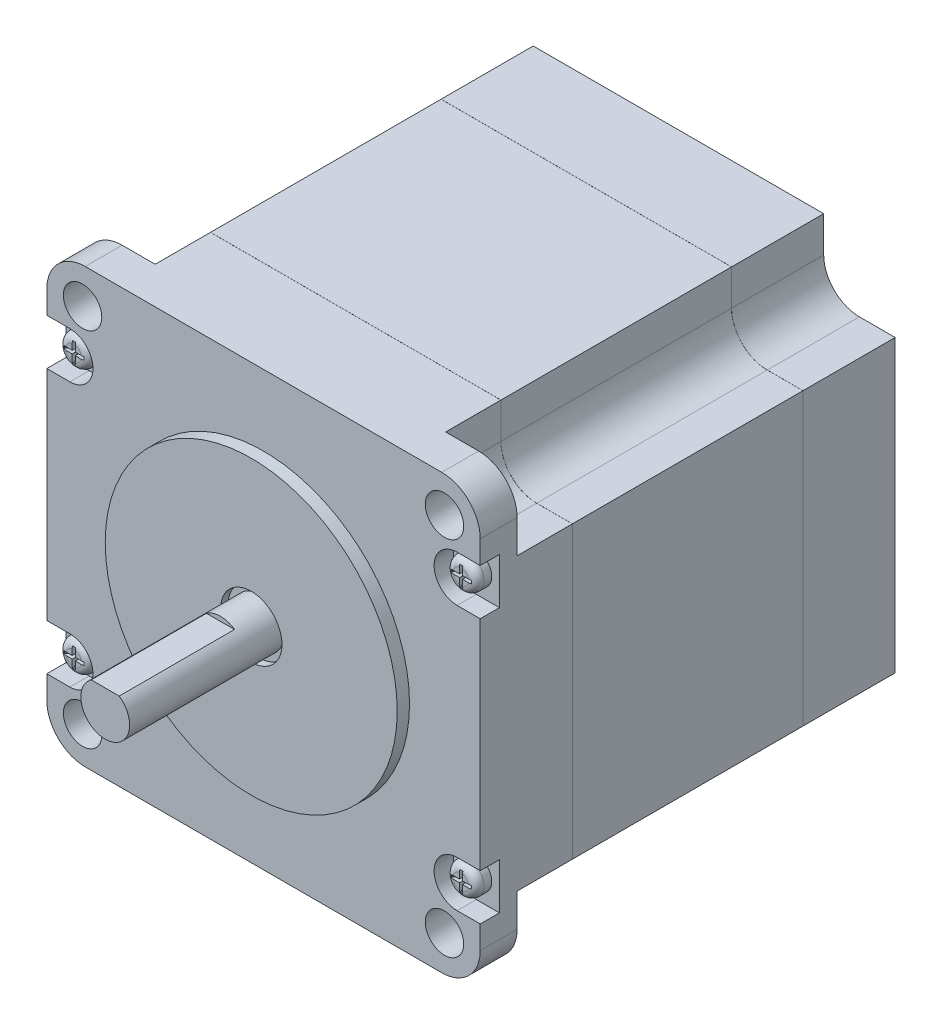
from build123d import *

# Parameters (mm, degrees)
SKETCH1_W             = 56.4
SKETCH1_H             = 56.4
BOSS_EXTRUDE1_DEPTH   = 54
SKETCH2_R             = 19
BOSS_EXTRUDE2_DEPTH   = 1.6
SKETCH3_R             = 2.5
CUT_EXTRUDE1_DEPTH    = 10
CUT_EXTRUDE2_DEPTH    = 49.2
FILLET1_R             = 5
SKETCH7_W             = 30.02
SKETCH7_H             = 56.42
SKETCH7_W_2           = 30
SKETCH7_H_2           = 56.4
CUT_EXTRUDE3_DEPTH    = 84.01927487
SKETCH8_R             = 6
CUT_EXTRUDE4_DEPTH    = 3
SKETCH9_R             = 3
BOSS_EXTRUDE3_DEPTH   = 1.5
CHAMFER1_SIZE         = 0.5
SKETCH10_R            = 4
CUT_EXTRUDE5_DEPTH    = 1
SKETCH11_R            = 3.175
BOSS_EXTRUDE4_DEPTH   = 20
CUT_EXTRUDE6_DEPTH    = 15
CUT_EXTRUDE7_DEPTH    = 2.5
SKETCH14_R            = 2
BOSS_EXTRUDE5_DEPTH   = 2
BOSS_EXTRUDE5_2_DEPTH = 2
BOSS_EXTRUDE5_3_DEPTH = 2
BOSS_EXTRUDE5_4_DEPTH = 2
FILLET2_R             = 1
FILLET3_R             = 1
FILLET4_R             = 1
FILLET5_R             = 1
CUT_EXTRUDE8_DEPTH    = 1.2
CHAMFER2_SIZE         = 1
CHAMFER3_SIZE         = 1
CHAMFER4_SIZE         = 1
CHAMFER5_SIZE         = 1


with BuildPart() as part:
    # Sketch1 → Boss-Extrude1 (new body)
    with BuildSketch(Plane.XY):
        Rectangle(SKETCH1_W, SKETCH1_H)
    extrude(amount=-BOSS_EXTRUDE1_DEPTH)

    # Sketch2 → Boss-Extrude2 (add)
    with BuildSketch(Plane.XY):
        with Locations(Location((0, 0, 0), (0, 0, 180))):
            Circle(SKETCH2_R)
    extrude(amount=BOSS_EXTRUDE2_DEPTH)

    # Sketch3 → Cut-Extrude1 (cut)
    with BuildSketch(Plane.XY):
        with Locations((-23.55, 23.55)):
            Circle(SKETCH3_R)
        with Locations((23.55, 23.55)):
            Circle(SKETCH3_R)
        with Locations((23.55, -23.55)):
            Circle(SKETCH3_R)
        with Locations((-23.55, -23.55)):
            Circle(SKETCH3_R)
    extrude(amount=-CUT_EXTRUDE1_DEPTH, mode=Mode.SUBTRACT)

    # Sketch6 → Cut-Extrude2 (cut)
    with BuildSketch(Plane(origin=(0, 0, -54), x_dir=(-1, 0, 0), z_dir=(0, 0, -1))):
        with BuildLine():
            Line((-18.9, 23.55), (-18.9, 28.2))
            Line((-18.9, 28.2), (-28.2, 28.2))
            Line((-28.2, 28.2), (-28.2, 18.9))
            Line((-28.2, 18.9), (-23.55, 18.9))
            ThreePointArc((-23.55, 18.9), (-20.261953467, 20.261953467), (-18.9, 23.55))
        make_face()
        with BuildLine():
            Line((28.2, 28.2), (28.2, 18.9))
            Line((28.2, 18.9), (23.55, 18.9))
            ThreePointArc((23.55, 18.9), (20.261953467, 20.261953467), (18.9, 23.55))
            Line((18.9, 23.55), (18.9, 28.2))
            Line((18.9, 28.2), (28.2, 28.2))
        make_face()
        with BuildLine():
            Line((-28.2, -28.2), (-28.2, -18.9))
            Line((-28.2, -18.9), (-23.55, -18.9))
            ThreePointArc((-23.55, -18.9), (-20.261953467, -20.261953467), (-18.9, -23.55))
            Line((-18.9, -23.55), (-18.9, -28.2))
            Line((-18.9, -28.2), (-28.2, -28.2))
        make_face()
        with BuildLine():
            Line((18.9, -23.55), (18.9, -28.2))
            Line((18.9, -28.2), (28.2, -28.2))
            Line((28.2, -28.2), (28.2, -18.9))
            Line((28.2, -18.9), (23.55, -18.9))
            ThreePointArc((23.55, -18.9), (20.261953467, -20.261953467), (18.9, -23.55))
        make_face()
    extrude(amount=-CUT_EXTRUDE2_DEPTH, mode=Mode.SUBTRACT)

    # Fillet1
    fillet1_edges = [part.edges().sort_by_distance(p)[0] for p in [
        (-28.2, 28.2, -2.4),
        (28.2, 28.2, -2.4),
        (28.2, -28.2, -2.4),
        (-28.2, -28.2, -2.4),
    ]]
    fillet(fillet1_edges, radius=FILLET1_R)

    # Sketch7 → Cut-Extrude3 (cut, through all)
    with BuildSketch(Plane.ZY.offset(28.2)):
        with Locations((-27, 0)):
            Rectangle(SKETCH7_W, SKETCH7_H)
        with Locations((-27, 0)):
            Rectangle(SKETCH7_W_2, SKETCH7_H_2, mode=Mode.SUBTRACT)
    extrude(amount=-CUT_EXTRUDE3_DEPTH, mode=Mode.SUBTRACT)


with BuildPart() as cut_extrude3_piece_1:
    # of the separate pieces the step leaves, piece 1, a body of its own (cut_extrude3_pieces)
    add(part.part.solids().sort_by_distance((-18.9, -28.2, -12))[0])


with BuildPart() as cut_extrude3_piece_2:
    # of the separate pieces the step leaves, piece 2, a body of its own (cut_extrude3_pieces)
    add(part.part.solids().sort_by_distance((-23.2, -28.2, 0))[0])

    # Sketch10 → Cut-Extrude5 (cut)
    with BuildSketch(Plane.XY.offset(1.6)):
        Circle(SKETCH10_R)
    extrude(amount=-CUT_EXTRUDE5_DEPTH, mode=Mode.SUBTRACT)

    # Sketch13 → Cut-Extrude7 (cut)
    with BuildSketch(Plane.XY):
        with BuildLine():
            Line((-25.2, 20.2), (-28.2, 20.2))
            Line((-28.2, 20.2), (-28.2, 14.2))
            Line((-28.2, 14.2), (-25.2, 14.2))
            ThreePointArc((-25.2, 14.2), (-22.2, 17.2), (-25.2, 20.2))
        make_face()
        with BuildLine():
            Line((28.2, 14.2), (25.2, 14.2))
            ThreePointArc((25.2, 14.2), (22.2, 17.2), (25.2, 20.2))
            Line((25.2, 20.2), (28.2, 20.2))
            Line((28.2, 20.2), (28.2, 14.2))
        make_face()
        with BuildLine():
            Line((25.2, -20.2), (28.2, -20.2))
            Line((28.2, -20.2), (28.2, -14.2))
            Line((28.2, -14.2), (25.2, -14.2))
            ThreePointArc((25.2, -14.2), (22.2, -17.2), (25.2, -20.2))
        make_face()
        with BuildLine():
            Line((-28.2, -14.2), (-25.2, -14.2))
            ThreePointArc((-25.2, -14.2), (-22.2, -17.2), (-25.2, -20.2))
            Line((-25.2, -20.2), (-28.2, -20.2))
            Line((-28.2, -20.2), (-28.2, -14.2))
        make_face()
    extrude(amount=-CUT_EXTRUDE7_DEPTH, mode=Mode.SUBTRACT)


with BuildPart() as cut_extrude3_piece_3:
    # of the separate pieces the step leaves, piece 3, a body of its own (cut_extrude3_pieces)
    add(part.part.solids().sort_by_distance((18.9, -28.2, -42.01))[0])

    # Sketch8 → Cut-Extrude4 (cut)
    with BuildSketch(Plane(origin=(0, 0, -54), x_dir=(-1, 0, 0), z_dir=(0, 0, -1))):
        Circle(SKETCH8_R)
    extrude(amount=-CUT_EXTRUDE4_DEPTH, mode=Mode.SUBTRACT)


with BuildPart() as body_4:
    # Sketch9 → Boss-Extrude3 (new body)
    with BuildSketch(Plane(origin=(0, 0, -51), x_dir=(-1, 0, 0), z_dir=(0, 0, -1))):
        Circle(SKETCH9_R)
    extrude(amount=BOSS_EXTRUDE3_DEPTH)

    # Chamfer1
    chamfer1_edges = [body_4.edges().sort_by_distance(p)[0] for p in [
        (3, 0, -52.5),
    ]]
    chamfer(chamfer1_edges, length=CHAMFER1_SIZE)


with BuildPart() as body_5:
    # Sketch11 → Boss-Extrude4 (new body)
    with BuildSketch(Plane.XY.offset(0.6)):
        Circle(SKETCH11_R)
    extrude(amount=BOSS_EXTRUDE4_DEPTH)

    # Sketch12 → Cut-Extrude6 (cut)
    with BuildSketch(Plane.XY.offset(20.6)):
        with BuildLine():
            Line((-1.822258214, 2.6), (1.822258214, 2.6))
            ThreePointArc((1.822258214, 2.6), (0, 3.175), (-1.822258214, 2.6))
        make_face()
    extrude(amount=-CUT_EXTRUDE6_DEPTH, mode=Mode.SUBTRACT)


with BuildPart() as body_6:
    # Sketch14 → Boss-Extrude5 (new body)
    with BuildSketch(Plane.XY.offset(-2.5)):
        with Locations((-25.2, 17.2)):
            Circle(SKETCH14_R)
    extrude(amount=BOSS_EXTRUDE5_DEPTH)

    # Fillet2
    fillet2_edges = [body_6.edges().sort_by_distance(p)[0] for p in [
        (-27.2, 17.2, -0.5),
    ]]
    fillet(fillet2_edges, radius=FILLET2_R)


with BuildPart() as body_7:
    # Sketch14 → Boss-Extrude5 2 (new body)
    with BuildSketch(Plane.XY.offset(-2.5)):
        with Locations((25.2, 17.2)):
            Circle(SKETCH14_R)
    extrude(amount=BOSS_EXTRUDE5_2_DEPTH)

    # Fillet5
    fillet5_edges = [body_7.edges().sort_by_distance(p)[0] for p in [
        (23.2, 17.2, -0.5),
    ]]
    fillet(fillet5_edges, radius=FILLET5_R)


with BuildPart() as body_8:
    # Sketch14 → Boss-Extrude5 3 (new body)
    with BuildSketch(Plane.XY.offset(-2.5)):
        with Locations((25.2, -17.2)):
            Circle(SKETCH14_R)
    extrude(amount=BOSS_EXTRUDE5_3_DEPTH)

    # Fillet4
    fillet4_edges = [body_8.edges().sort_by_distance(p)[0] for p in [
        (23.2, -17.2, -0.5),
    ]]
    fillet(fillet4_edges, radius=FILLET4_R)


with BuildPart() as body_9:
    # Sketch14 → Boss-Extrude5 4 (new body)
    with BuildSketch(Plane.XY.offset(-2.5)):
        with Locations((-25.2, -17.2)):
            Circle(SKETCH14_R)
    extrude(amount=BOSS_EXTRUDE5_4_DEPTH)

    # Fillet3
    fillet3_edges = [body_9.edges().sort_by_distance(p)[0] for p in [
        (-27.2, -17.2, -0.5),
    ]]
    fillet(fillet3_edges, radius=FILLET3_R)


with BuildPart() as cut_extrude8_tool:
    # Sketch15 → Cut-Extrude8 (new body)
    with BuildSketch(Plane.XY.offset(-0.5)):
        Polygon((-25.398960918, 17.403859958), (-25.398960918, 18.476027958), (-25.001039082, 18.476027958), (-25.001039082, 17.403859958), (-23.892552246, 17.403859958), (-23.892552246, 16.996140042), (-25.001039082, 16.996140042), (-25.001039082, 15.923972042), (-25.398960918, 15.923972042), (-25.398960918, 16.996140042), (-26.507447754, 16.996140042), (-26.507447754, 17.403859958), align=None)
        Polygon((25.001039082, 17.403859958), (25.001039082, 18.476027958), (25.398960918, 18.476027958), (25.398960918, 17.403859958), (26.507447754, 17.403859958), (26.507447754, 16.996140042), (25.398960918, 16.996140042), (25.398960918, 15.923972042), (25.001039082, 15.923972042), (25.001039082, 16.996140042), (23.892552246, 16.996140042), (23.892552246, 17.403859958), align=None)
        Polygon((25.398960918, -17.403859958), (25.398960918, -18.476027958), (25.001039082, -18.476027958), (25.001039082, -17.403859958), (23.892552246, -17.403859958), (23.892552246, -16.996140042), (25.001039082, -16.996140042), (25.001039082, -15.923972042), (25.398960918, -15.923972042), (25.398960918, -16.996140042), (26.507447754, -16.996140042), (26.507447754, -17.403859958), align=None)
        Polygon((-25.001039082, -17.403859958), (-25.001039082, -18.476027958), (-25.398960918, -18.476027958), (-25.398960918, -17.403859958), (-26.507447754, -17.403859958), (-26.507447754, -16.996140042), (-25.398960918, -16.996140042), (-25.398960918, -15.923972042), (-25.001039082, -15.923972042), (-25.001039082, -16.996140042), (-23.892552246, -16.996140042), (-23.892552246, -17.403859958), align=None)
    extrude(amount=-CUT_EXTRUDE8_DEPTH)


with BuildPart() as body_6_1:
    add(body_6.part)

    # Cut-Extrude8: cut by cut_extrude8_tool
    add(cut_extrude8_tool.part, mode=Mode.SUBTRACT)

    # Chamfer2
    chamfer2_edges = [body_6_1.edges().sort_by_distance(p)[0] for p in [
        (-23.892552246, 17.2, -1.7),
        (-25.2, 15.923972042, -1.7),
        (-26.507447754, 17.2, -1.7),
        (-25.2, 18.476027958, -1.7),
    ]]
    chamfer(chamfer2_edges, length=CHAMFER2_SIZE)


with BuildPart() as body_7_1:
    add(body_7.part)

    # Cut-Extrude8: cut by cut_extrude8_tool
    add(cut_extrude8_tool.part, mode=Mode.SUBTRACT)

    # Chamfer3
    chamfer3_edges = [body_7_1.edges().sort_by_distance(p)[0] for p in [
        (26.507447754, 17.2, -1.7),
        (25.2, 15.923972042, -1.7),
        (23.892552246, 17.2, -1.7),
        (25.2, 18.476027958, -1.7),
    ]]
    chamfer(chamfer3_edges, length=CHAMFER3_SIZE)


with BuildPart() as body_8_1:
    add(body_8.part)

    # Cut-Extrude8: cut by cut_extrude8_tool
    add(cut_extrude8_tool.part, mode=Mode.SUBTRACT)

    # Chamfer4
    chamfer4_edges = [body_8_1.edges().sort_by_distance(p)[0] for p in [
        (26.507447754, -17.2, -1.7),
        (25.2, -18.476027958, -1.7),
        (23.892552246, -17.2, -1.7),
        (25.2, -15.923972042, -1.7),
    ]]
    chamfer(chamfer4_edges, length=CHAMFER4_SIZE)


with BuildPart() as body_9_1:
    add(body_9.part)

    # Cut-Extrude8: cut by cut_extrude8_tool
    add(cut_extrude8_tool.part, mode=Mode.SUBTRACT)

    # Chamfer5
    chamfer5_edges = [body_9_1.edges().sort_by_distance(p)[0] for p in [
        (-26.507447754, -17.2, -1.7),
        (-25.2, -15.923972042, -1.7),
        (-23.892552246, -17.2, -1.7),
        (-25.2, -18.476027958, -1.7),
    ]]
    chamfer(chamfer5_edges, length=CHAMFER5_SIZE)


solid = Compound([cut_extrude3_piece_1.part, cut_extrude3_piece_2.part, cut_extrude3_piece_3.part, body_4.part, body_5.part, body_6_1.part, body_7_1.part, body_8_1.part, body_9_1.part])
